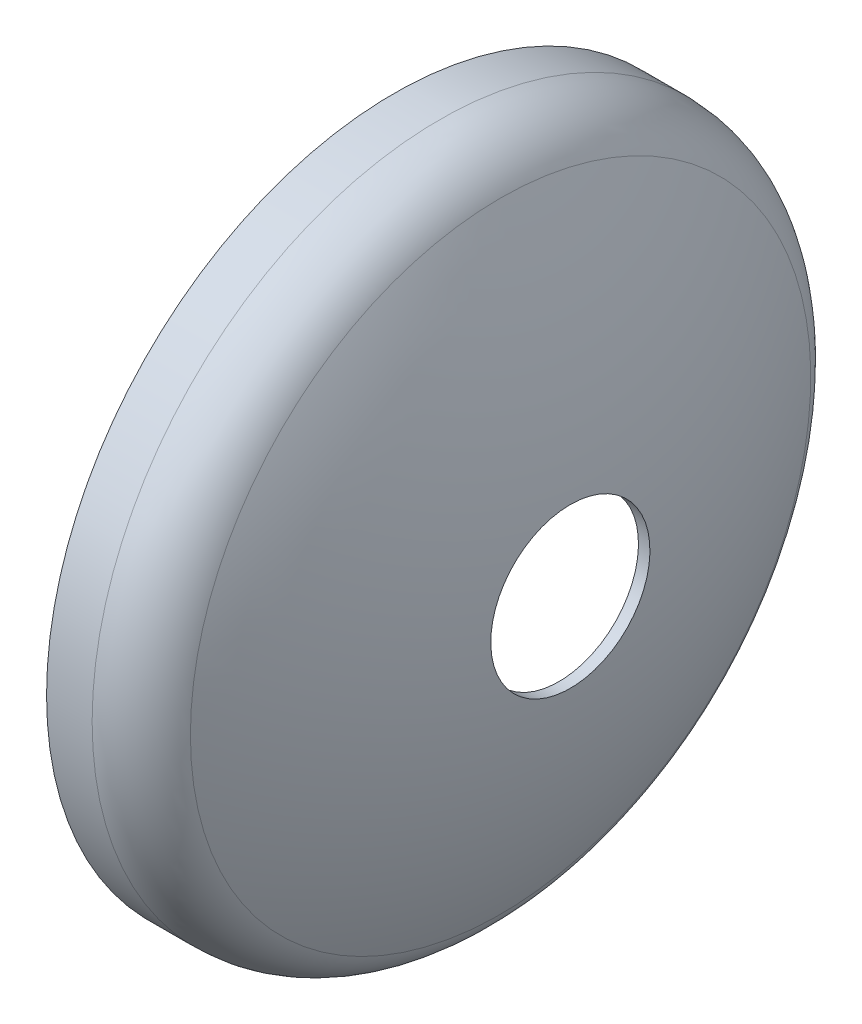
from build123d import *

# Parameters (mm, degrees)
ESQUISSE2_R             = 69.85
ENL_V_MAT_EXTRU_1_DEPTH = 1995.437456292


with BuildPart() as part:
    # Esquisse1 → R_volution3 (revolve)
    with BuildSketch(Plane.XY, mode=Mode.PRIVATE) as r_volution3_sk:
        with BuildLine():
            Line((550, 305), (590, 305))
            ThreePointArc((590, 305), (621.358146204, 296.153364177), (643.469155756, 272.222222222))
            ThreePointArc((643.469155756, 272.222222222), (692.222083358, 139.973328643), (708.777598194, 0))
            Line((708.777598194, 0), (698.777598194, 0))
            ThreePointArc((698.777598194, 0), (682.498008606, 137.640439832), (634.557629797, 267.685185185))
            ThreePointArc((634.557629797, 267.685185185), (616.131788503, 287.627803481), (590, 295))
            Line((590, 295), (550, 295))
            Line((550, 295), (550, 305))
        make_face()
    revolve(r_volution3_sk.sketch.rotate(Axis((57.19013108, 0, 0), (1, 0, 0)), 90), axis=Axis((57.19013108, 0, 0), (1, 0, 0)))

    # Esquisse2 → Enl_v. mat.-Extru.1 (cut)
    with BuildSketch(Plane(origin=(0, 0, 0), x_dir=(0, 0, -1), z_dir=(1, 0, 0))):
        with Locations(Location((0, 0, 0), (0, 0, 90))):
            Circle(ESQUISSE2_R)
    extrude(amount=ENL_V_MAT_EXTRU_1_DEPTH, mode=Mode.SUBTRACT)


solid = part.part
